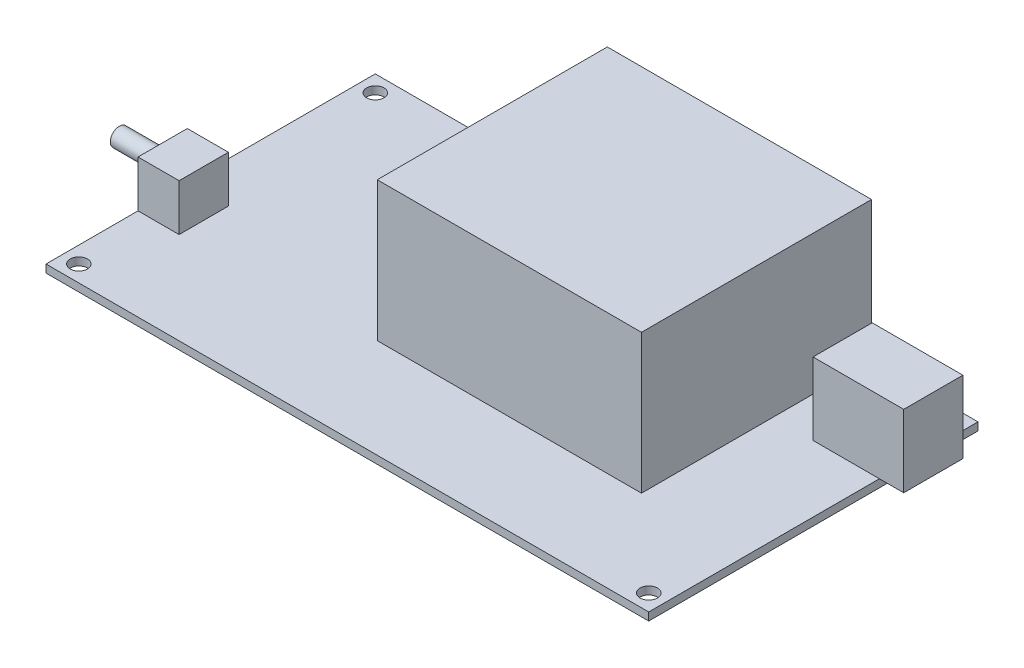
ISO-10303-21;
HEADER;
FILE_DESCRIPTION(('STEP AP214'),'2;1');
FILE_NAME('part.step','',(''),(''),'','','');
FILE_SCHEMA(('AUTOMOTIVE_DESIGN { 1 0 10303 214 1 1 1 1 }'));
ENDSEC;
DATA;
#1=APPLICATION_CONTEXT('core data for automotive mechanical design processes');
#2=APPLICATION_PROTOCOL_DEFINITION('international standard','automotive_design',2000,#1);
#3=PRODUCT_CONTEXT('',#1,'mechanical');
#4=PRODUCT('Part','Part','',(#3));
#5=PRODUCT_RELATED_PRODUCT_CATEGORY('part','',(#4));
#6=PRODUCT_DEFINITION_FORMATION('','',#4);
#7=PRODUCT_DEFINITION_CONTEXT('part definition',#1,'design');
#8=PRODUCT_DEFINITION('design','',#6,#7);
#9=PRODUCT_DEFINITION_SHAPE('','',#8);
#10=(LENGTH_UNIT() NAMED_UNIT(*) SI_UNIT(.MILLI.,.METRE.));
#11=(NAMED_UNIT(*) PLANE_ANGLE_UNIT() SI_UNIT($,.RADIAN.));
#12=(NAMED_UNIT(*) SI_UNIT($,.STERADIAN.) SOLID_ANGLE_UNIT());
#13=UNCERTAINTY_MEASURE_WITH_UNIT(LENGTH_MEASURE(1.E-05),#10,'distance_accuracy_value','');
#14=(GEOMETRIC_REPRESENTATION_CONTEXT(3) GLOBAL_UNCERTAINTY_ASSIGNED_CONTEXT((#13)) GLOBAL_UNIT_ASSIGNED_CONTEXT((#10,
#11,#12)) REPRESENTATION_CONTEXT('',''));
#15=CARTESIAN_POINT('',(0.,0.,0.));
#16=DIRECTION('',(0.,0.,1.));
#17=DIRECTION('',(1.,0.,0.));
#18=AXIS2_PLACEMENT_3D('',#15,#16,#17);
#19=CARTESIAN_POINT('',(0.,1.2,0.));
#20=DIRECTION('',(0.,1.,0.));
#21=DIRECTION('',(0.,0.,1.));
#22=AXIS2_PLACEMENT_3D('',#19,#20,#21);
#23=PLANE('',#22);
#24=CARTESIAN_POINT('',(-43.35,1.2,22.55));
#25=DIRECTION('',(0.,1.,0.));
#26=DIRECTION('',(0.,0.,1.));
#27=AXIS2_PLACEMENT_3D('',#24,#25,#26);
#28=CIRCLE('',#27,1.32);
#29=CARTESIAN_POINT('',(-43.35,1.2,23.87));
#30=VERTEX_POINT('',#29);
#31=EDGE_CURVE('E363',#30,#30,#28,.T.);
#32=ORIENTED_EDGE('',*,*,#31,.F.);
#33=EDGE_LOOP('',(#32));
#34=FACE_BOUND('',#33,.T.);
#35=CARTESIAN_POINT('',(43.35,1.2,22.55));
#36=DIRECTION('',(0.,1.,0.));
#37=DIRECTION('',(0.,0.,1.));
#38=AXIS2_PLACEMENT_3D('',#35,#36,#37);
#39=CIRCLE('',#38,1.32);
#40=CARTESIAN_POINT('',(43.35,1.2,23.87));
#41=VERTEX_POINT('',#40);
#42=EDGE_CURVE('E379',#41,#41,#39,.T.);
#43=ORIENTED_EDGE('',*,*,#42,.F.);
#44=EDGE_LOOP('',(#43));
#45=FACE_BOUND('',#44,.T.);
#46=CARTESIAN_POINT('',(-43.35,1.2,-22.55));
#47=DIRECTION('',(0.,1.,0.));
#48=DIRECTION('',(0.,0.,1.));
#49=AXIS2_PLACEMENT_3D('',#46,#47,#48);
#50=CIRCLE('',#49,1.32);
#51=CARTESIAN_POINT('',(-43.35,1.2,-21.23));
#52=VERTEX_POINT('',#51);
#53=EDGE_CURVE('E371',#52,#52,#50,.T.);
#54=ORIENTED_EDGE('',*,*,#53,.F.);
#55=EDGE_LOOP('',(#54));
#56=FACE_BOUND('',#55,.T.);
#57=CARTESIAN_POINT('',(43.35,1.2,-22.55));
#58=DIRECTION('',(0.,1.,0.));
#59=DIRECTION('',(0.,0.,1.));
#60=AXIS2_PLACEMENT_3D('',#57,#58,#59);
#61=CIRCLE('',#60,1.32);
#62=CARTESIAN_POINT('',(43.35,1.2,-21.23));
#63=VERTEX_POINT('',#62);
#64=EDGE_CURVE('E355',#63,#63,#61,.T.);
#65=ORIENTED_EDGE('',*,*,#64,.F.);
#66=EDGE_LOOP('',(#65));
#67=FACE_BOUND('',#66,.T.);
#68=DIRECTION('',(0.,0.,1.));
#69=VECTOR('',#68,1.);
#70=CARTESIAN_POINT('',(-45.85,1.2,-25.05));
#71=LINE('',#70,#69);
#72=CARTESIAN_POINT('',(-45.85,1.2,-25.05));
#73=VERTEX_POINT('',#72);
#74=CARTESIAN_POINT('',(-45.85,1.2,3.54999999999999));
#75=VERTEX_POINT('',#74);
#76=EDGE_CURVE('E398',#73,#75,#71,.T.);
#77=ORIENTED_EDGE('',*,*,#76,.T.);
#78=DIRECTION('',(-1.,0.,0.));
#79=VECTOR('',#78,1.);
#80=CARTESIAN_POINT('',(-45.85,1.2,3.54999999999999));
#81=LINE('',#80,#79);
#82=CARTESIAN_POINT('',(-39.6,1.2,3.54999999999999));
#83=VERTEX_POINT('',#82);
#84=EDGE_CURVE('E133',#83,#75,#81,.T.);
#85=ORIENTED_EDGE('',*,*,#84,.F.);
#86=DIRECTION('',(0.,0.,-1.));
#87=VECTOR('',#86,1.);
#88=CARTESIAN_POINT('',(-39.6,1.2,3.54999999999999));
#89=LINE('',#88,#87);
#90=CARTESIAN_POINT('',(-39.6,1.2,11.05));
#91=VERTEX_POINT('',#90);
#92=EDGE_CURVE('E138',#91,#83,#89,.T.);
#93=ORIENTED_EDGE('',*,*,#92,.F.);
#94=DIRECTION('',(1.,0.,0.));
#95=VECTOR('',#94,1.);
#96=CARTESIAN_POINT('',(-45.85,1.2,11.05));
#97=LINE('',#96,#95);
#98=CARTESIAN_POINT('',(-45.85,1.2,11.05));
#99=VERTEX_POINT('',#98);
#100=EDGE_CURVE('E257',#99,#91,#97,.T.);
#101=ORIENTED_EDGE('',*,*,#100,.F.);
#102=CARTESIAN_POINT('',(-45.85,1.2,25.05));
#103=VERTEX_POINT('',#102);
#104=EDGE_CURVE('E397',#99,#103,#71,.T.);
#105=ORIENTED_EDGE('',*,*,#104,.T.);
#106=DIRECTION('',(1.,0.,0.));
#107=VECTOR('',#106,1.);
#108=CARTESIAN_POINT('',(-45.85,1.2,25.05));
#109=LINE('',#108,#107);
#110=CARTESIAN_POINT('',(45.85,1.2,25.05));
#111=VERTEX_POINT('',#110);
#112=EDGE_CURVE('E401',#103,#111,#109,.T.);
#113=ORIENTED_EDGE('',*,*,#112,.T.);
#114=DIRECTION('',(0.,0.,-1.));
#115=VECTOR('',#114,1.);
#116=CARTESIAN_POINT('',(45.85,1.2,-25.05));
#117=LINE('',#116,#115);
#118=CARTESIAN_POINT('',(45.85,1.2,-10.05));
#119=VERTEX_POINT('',#118);
#120=EDGE_CURVE('E387',#111,#119,#117,.T.);
#121=ORIENTED_EDGE('',*,*,#120,.T.);
#122=DIRECTION('',(1.,0.,0.));
#123=VECTOR('',#122,1.);
#124=CARTESIAN_POINT('',(35.75,1.2,-10.05));
#125=LINE('',#124,#123);
#126=CARTESIAN_POINT('',(35.75,1.2,-10.05));
#127=VERTEX_POINT('',#126);
#128=EDGE_CURVE('E325',#127,#119,#125,.T.);
#129=ORIENTED_EDGE('',*,*,#128,.F.);
#130=DIRECTION('',(0.,0.,1.));
#131=VECTOR('',#130,1.);
#132=CARTESIAN_POINT('',(35.75,1.2,-19.05));
#133=LINE('',#132,#131);
#134=CARTESIAN_POINT('',(35.75,1.2,-19.05));
#135=VERTEX_POINT('',#134);
#136=EDGE_CURVE('E313',#135,#127,#133,.T.);
#137=ORIENTED_EDGE('',*,*,#136,.F.);
#138=DIRECTION('',(1.,0.,0.));
#139=VECTOR('',#138,1.);
#140=CARTESIAN_POINT('',(35.75,1.2,-19.05));
#141=LINE('',#140,#139);
#142=CARTESIAN_POINT('',(45.85,1.2,-19.05));
#143=VERTEX_POINT('',#142);
#144=EDGE_CURVE('E334',#135,#143,#141,.T.);
#145=ORIENTED_EDGE('',*,*,#144,.T.);
#146=CARTESIAN_POINT('',(45.85,1.2,-25.05));
#147=VERTEX_POINT('',#146);
#148=EDGE_CURVE('E393',#143,#147,#117,.T.);
#149=ORIENTED_EDGE('',*,*,#148,.T.);
#150=DIRECTION('',(-1.,0.,0.));
#151=VECTOR('',#150,1.);
#152=CARTESIAN_POINT('',(-45.85,1.2,-25.05));
#153=LINE('',#152,#151);
#154=CARTESIAN_POINT('',(29.65,1.2,-25.05));
#155=VERTEX_POINT('',#154);
#156=EDGE_CURVE('E394',#147,#155,#153,.T.);
#157=ORIENTED_EDGE('',*,*,#156,.T.);
#158=DIRECTION('',(0.,0.,-1.));
#159=VECTOR('',#158,1.);
#160=CARTESIAN_POINT('',(29.65,1.2,-25.05));
#161=LINE('',#160,#159);
#162=CARTESIAN_POINT('',(29.65,1.2,9.95));
#163=VERTEX_POINT('',#162);
#164=EDGE_CURVE('E261',#163,#155,#161,.T.);
#165=ORIENTED_EDGE('',*,*,#164,.F.);
#166=DIRECTION('',(1.,0.,0.));
#167=VECTOR('',#166,1.);
#168=CARTESIAN_POINT('',(29.65,1.2,9.95));
#169=LINE('',#168,#167);
#170=CARTESIAN_POINT('',(-10.55,1.2,9.95));
#171=VERTEX_POINT('',#170);
#172=EDGE_CURVE('E277',#171,#163,#169,.T.);
#173=ORIENTED_EDGE('',*,*,#172,.F.);
#174=DIRECTION('',(0.,0.,1.));
#175=VECTOR('',#174,1.);
#176=CARTESIAN_POINT('',(-10.55,1.2,-25.05));
#177=LINE('',#176,#175);
#178=CARTESIAN_POINT('',(-10.55,1.2,-25.05));
#179=VERTEX_POINT('',#178);
#180=EDGE_CURVE('E266',#179,#171,#177,.T.);
#181=ORIENTED_EDGE('',*,*,#180,.F.);
#182=EDGE_CURVE('E391',#179,#73,#153,.T.);
#183=ORIENTED_EDGE('',*,*,#182,.T.);
#184=EDGE_LOOP('',(#77,#85,#93,#101,#105,#113,#121,#129,#137,#145,#149,#157,#165,#173,#181,#183));
#185=FACE_BOUND('',#184,.T.);
#186=ADVANCED_FACE('F117',(#34,#45,#56,#67,#185),#23,.T.);
#187=CARTESIAN_POINT('',(0.,0.,0.));
#188=DIRECTION('',(0.,1.,0.));
#189=DIRECTION('',(0.,0.,1.));
#190=AXIS2_PLACEMENT_3D('',#187,#188,#189);
#191=PLANE('',#190);
#192=DIRECTION('',(0.,0.,-1.));
#193=VECTOR('',#192,1.);
#194=CARTESIAN_POINT('',(45.85,0.,-25.05));
#195=LINE('',#194,#193);
#196=CARTESIAN_POINT('',(45.85,0.,25.05));
#197=VERTEX_POINT('',#196);
#198=CARTESIAN_POINT('',(45.85,0.,-25.05));
#199=VERTEX_POINT('',#198);
#200=EDGE_CURVE('E383',#197,#199,#195,.T.);
#201=ORIENTED_EDGE('',*,*,#200,.F.);
#202=DIRECTION('',(1.,0.,0.));
#203=VECTOR('',#202,1.);
#204=CARTESIAN_POINT('',(-45.85,0.,25.05));
#205=LINE('',#204,#203);
#206=CARTESIAN_POINT('',(-45.85,0.,25.05));
#207=VERTEX_POINT('',#206);
#208=EDGE_CURVE('E414',#207,#197,#205,.T.);
#209=ORIENTED_EDGE('',*,*,#208,.F.);
#210=DIRECTION('',(0.,0.,1.));
#211=VECTOR('',#210,1.);
#212=CARTESIAN_POINT('',(-45.85,0.,-25.05));
#213=LINE('',#212,#211);
#214=CARTESIAN_POINT('',(-45.85,0.,-25.05));
#215=VERTEX_POINT('',#214);
#216=EDGE_CURVE('E411',#215,#207,#213,.T.);
#217=ORIENTED_EDGE('',*,*,#216,.F.);
#218=DIRECTION('',(-1.,0.,0.));
#219=VECTOR('',#218,1.);
#220=CARTESIAN_POINT('',(-45.85,0.,-25.05));
#221=LINE('',#220,#219);
#222=EDGE_CURVE('E408',#199,#215,#221,.T.);
#223=ORIENTED_EDGE('',*,*,#222,.F.);
#224=EDGE_LOOP('',(#201,#209,#217,#223));
#225=FACE_BOUND('',#224,.T.);
#226=CARTESIAN_POINT('',(43.35,0.,22.55));
#227=DIRECTION('',(0.,1.,0.));
#228=DIRECTION('',(0.,0.,1.));
#229=AXIS2_PLACEMENT_3D('',#226,#227,#228);
#230=CIRCLE('',#229,1.32);
#231=CARTESIAN_POINT('',(43.35,0.,23.87));
#232=VERTEX_POINT('',#231);
#233=EDGE_CURVE('E375',#232,#232,#230,.T.);
#234=ORIENTED_EDGE('',*,*,#233,.T.);
#235=EDGE_LOOP('',(#234));
#236=FACE_BOUND('',#235,.T.);
#237=CARTESIAN_POINT('',(-43.35,0.,-22.55));
#238=DIRECTION('',(0.,1.,0.));
#239=DIRECTION('',(0.,0.,1.));
#240=AXIS2_PLACEMENT_3D('',#237,#238,#239);
#241=CIRCLE('',#240,1.32);
#242=CARTESIAN_POINT('',(-43.35,0.,-21.23));
#243=VERTEX_POINT('',#242);
#244=EDGE_CURVE('E367',#243,#243,#241,.T.);
#245=ORIENTED_EDGE('',*,*,#244,.T.);
#246=EDGE_LOOP('',(#245));
#247=FACE_BOUND('',#246,.T.);
#248=CARTESIAN_POINT('',(-43.35,0.,22.55));
#249=DIRECTION('',(0.,1.,0.));
#250=DIRECTION('',(0.,0.,1.));
#251=AXIS2_PLACEMENT_3D('',#248,#249,#250);
#252=CIRCLE('',#251,1.32);
#253=CARTESIAN_POINT('',(-43.35,0.,23.87));
#254=VERTEX_POINT('',#253);
#255=EDGE_CURVE('E359',#254,#254,#252,.T.);
#256=ORIENTED_EDGE('',*,*,#255,.T.);
#257=EDGE_LOOP('',(#256));
#258=FACE_BOUND('',#257,.T.);
#259=CARTESIAN_POINT('',(43.35,0.,-22.55));
#260=DIRECTION('',(0.,1.,0.));
#261=DIRECTION('',(0.,0.,1.));
#262=AXIS2_PLACEMENT_3D('',#259,#260,#261);
#263=CIRCLE('',#262,1.32);
#264=CARTESIAN_POINT('',(43.35,0.,-21.23));
#265=VERTEX_POINT('',#264);
#266=EDGE_CURVE('E354',#265,#265,#263,.T.);
#267=ORIENTED_EDGE('',*,*,#266,.T.);
#268=EDGE_LOOP('',(#267));
#269=FACE_BOUND('',#268,.T.);
#270=ADVANCED_FACE('F441',(#225,#236,#247,#258,#269),#191,.F.);
#271=CARTESIAN_POINT('',(45.85,1.2,-25.05));
#272=DIRECTION('',(-1.,0.,0.));
#273=DIRECTION('',(0.,0.,1.));
#274=AXIS2_PLACEMENT_3D('',#271,#272,#273);
#275=PLANE('',#274);
#276=ORIENTED_EDGE('',*,*,#200,.T.);
#277=DIRECTION('',(0.,-1.,0.));
#278=VECTOR('',#277,1.);
#279=CARTESIAN_POINT('',(45.85,1.2,-25.05));
#280=LINE('',#279,#278);
#281=EDGE_CURVE('E126',#147,#199,#280,.T.);
#282=ORIENTED_EDGE('',*,*,#281,.F.);
#283=ORIENTED_EDGE('',*,*,#148,.F.);
#284=EDGE_CURVE('E392',#119,#143,#117,.T.);
#285=ORIENTED_EDGE('',*,*,#284,.F.);
#286=ORIENTED_EDGE('',*,*,#120,.F.);
#287=DIRECTION('',(0.,-1.,0.));
#288=VECTOR('',#287,1.);
#289=CARTESIAN_POINT('',(45.85,1.2,25.05));
#290=LINE('',#289,#288);
#291=EDGE_CURVE('E404',#111,#197,#290,.T.);
#292=ORIENTED_EDGE('',*,*,#291,.T.);
#293=EDGE_LOOP('',(#276,#282,#283,#285,#286,#292));
#294=FACE_BOUND('',#293,.T.);
#295=ADVANCED_FACE('F119',(#294),#275,.F.);
#296=CARTESIAN_POINT('',(-45.85,1.2,-25.05));
#297=DIRECTION('',(0.,0.,1.));
#298=DIRECTION('',(1.,0.,0.));
#299=AXIS2_PLACEMENT_3D('',#296,#297,#298);
#300=PLANE('',#299);
#301=ORIENTED_EDGE('',*,*,#222,.T.);
#302=DIRECTION('',(0.,-1.,0.));
#303=VECTOR('',#302,1.);
#304=CARTESIAN_POINT('',(-45.85,1.2,-25.05));
#305=LINE('',#304,#303);
#306=EDGE_CURVE('E424',#73,#215,#305,.T.);
#307=ORIENTED_EDGE('',*,*,#306,.F.);
#308=ORIENTED_EDGE('',*,*,#182,.F.);
#309=DIRECTION('',(0.,-1.,0.));
#310=VECTOR('',#309,1.);
#311=CARTESIAN_POINT('',(-10.55,22.4,-25.05));
#312=LINE('',#311,#310);
#313=CARTESIAN_POINT('',(-10.55,22.4,-25.05));
#314=VERTEX_POINT('',#313);
#315=EDGE_CURVE('E300',#314,#179,#312,.T.);
#316=ORIENTED_EDGE('',*,*,#315,.F.);
#317=DIRECTION('',(-1.,0.,0.));
#318=VECTOR('',#317,1.);
#319=CARTESIAN_POINT('',(29.65,22.4,-25.05));
#320=LINE('',#319,#318);
#321=CARTESIAN_POINT('',(29.65,22.4,-25.05));
#322=VERTEX_POINT('',#321);
#323=EDGE_CURVE('E276',#322,#314,#320,.T.);
#324=ORIENTED_EDGE('',*,*,#323,.F.);
#325=DIRECTION('',(0.,-1.,0.));
#326=VECTOR('',#325,1.);
#327=CARTESIAN_POINT('',(29.65,22.4,-25.05));
#328=LINE('',#327,#326);
#329=EDGE_CURVE('E304',#322,#155,#328,.T.);
#330=ORIENTED_EDGE('',*,*,#329,.T.);
#331=ORIENTED_EDGE('',*,*,#156,.F.);
#332=ORIENTED_EDGE('',*,*,#281,.T.);
#333=EDGE_LOOP('',(#301,#307,#308,#316,#324,#330,#331,#332));
#334=FACE_BOUND('',#333,.T.);
#335=ADVANCED_FACE('F432',(#334),#300,.F.);
#336=CARTESIAN_POINT('',(-45.85,1.2,-25.05));
#337=DIRECTION('',(1.,0.,0.));
#338=DIRECTION('',(0.,0.,-1.));
#339=AXIS2_PLACEMENT_3D('',#336,#337,#338);
#340=PLANE('',#339);
#341=CARTESIAN_POINT('',(-45.85,5.8,7.29999999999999));
#342=DIRECTION('',(1.,0.,0.));
#343=DIRECTION('',(0.,0.,-1.));
#344=AXIS2_PLACEMENT_3D('',#341,#342,#343);
#345=CIRCLE('',#344,1.37363755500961);
#346=CARTESIAN_POINT('',(-45.85,5.8,5.92636244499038));
#347=VERTEX_POINT('',#346);
#348=EDGE_CURVE('E15',#347,#347,#345,.F.);
#349=ORIENTED_EDGE('',*,*,#348,.F.);
#350=EDGE_LOOP('',(#349));
#351=FACE_BOUND('',#350,.T.);
#352=ORIENTED_EDGE('',*,*,#216,.T.);
#353=DIRECTION('',(0.,-1.,0.));
#354=VECTOR('',#353,1.);
#355=CARTESIAN_POINT('',(-45.85,1.2,25.05));
#356=LINE('',#355,#354);
#357=EDGE_CURVE('E420',#103,#207,#356,.T.);
#358=ORIENTED_EDGE('',*,*,#357,.F.);
#359=ORIENTED_EDGE('',*,*,#104,.F.);
#360=DIRECTION('',(0.,-1.,0.));
#361=VECTOR('',#360,1.);
#362=CARTESIAN_POINT('',(-45.85,8.3,11.05));
#363=LINE('',#362,#361);
#364=CARTESIAN_POINT('',(-45.85,8.3,11.05));
#365=VERTEX_POINT('',#364);
#366=EDGE_CURVE('E268',#365,#99,#363,.T.);
#367=ORIENTED_EDGE('',*,*,#366,.F.);
#368=DIRECTION('',(0.,0.,1.));
#369=VECTOR('',#368,1.);
#370=CARTESIAN_POINT('',(-45.85,8.3,3.54999999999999));
#371=LINE('',#370,#369);
#372=CARTESIAN_POINT('',(-45.85,8.3,3.54999999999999));
#373=VERTEX_POINT('',#372);
#374=EDGE_CURVE('E246',#373,#365,#371,.T.);
#375=ORIENTED_EDGE('',*,*,#374,.F.);
#376=DIRECTION('',(0.,-1.,0.));
#377=VECTOR('',#376,1.);
#378=CARTESIAN_POINT('',(-45.85,8.3,3.54999999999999));
#379=LINE('',#378,#377);
#380=EDGE_CURVE('E242',#373,#75,#379,.T.);
#381=ORIENTED_EDGE('',*,*,#380,.T.);
#382=ORIENTED_EDGE('',*,*,#76,.F.);
#383=ORIENTED_EDGE('',*,*,#306,.T.);
#384=EDGE_LOOP('',(#352,#358,#359,#367,#375,#381,#382,#383));
#385=FACE_BOUND('',#384,.T.);
#386=ADVANCED_FACE('F446',(#351,#385),#340,.F.);
#387=CARTESIAN_POINT('',(-45.85,1.2,25.05));
#388=DIRECTION('',(0.,0.,-1.));
#389=DIRECTION('',(-1.,0.,0.));
#390=AXIS2_PLACEMENT_3D('',#387,#388,#389);
#391=PLANE('',#390);
#392=ORIENTED_EDGE('',*,*,#208,.T.);
#393=ORIENTED_EDGE('',*,*,#291,.F.);
#394=ORIENTED_EDGE('',*,*,#112,.F.);
#395=ORIENTED_EDGE('',*,*,#357,.T.);
#396=EDGE_LOOP('',(#392,#393,#394,#395));
#397=FACE_BOUND('',#396,.T.);
#398=ADVANCED_FACE('F450',(#397),#391,.F.);
#399=CARTESIAN_POINT('',(43.35,1.2,22.55));
#400=DIRECTION('',(0.,-1.,0.));
#401=DIRECTION('',(0.,0.,-1.));
#402=AXIS2_PLACEMENT_3D('',#399,#400,#401);
#403=CYLINDRICAL_SURFACE('',#402,1.32);
#404=ORIENTED_EDGE('',*,*,#42,.T.);
#405=EDGE_LOOP('',(#404));
#406=FACE_BOUND('',#405,.T.);
#407=ORIENTED_EDGE('',*,*,#233,.F.);
#408=EDGE_LOOP('',(#407));
#409=FACE_BOUND('',#408,.T.);
#410=ADVANCED_FACE('F502',(#406,#409),#403,.F.);
#411=CARTESIAN_POINT('',(-43.35,1.2,-22.55));
#412=DIRECTION('',(0.,-1.,0.));
#413=DIRECTION('',(0.,0.,-1.));
#414=AXIS2_PLACEMENT_3D('',#411,#412,#413);
#415=CYLINDRICAL_SURFACE('',#414,1.32);
#416=ORIENTED_EDGE('',*,*,#53,.T.);
#417=EDGE_LOOP('',(#416));
#418=FACE_BOUND('',#417,.T.);
#419=ORIENTED_EDGE('',*,*,#244,.F.);
#420=EDGE_LOOP('',(#419));
#421=FACE_BOUND('',#420,.T.);
#422=ADVANCED_FACE('F537',(#418,#421),#415,.F.);
#423=CARTESIAN_POINT('',(-43.35,1.2,22.55));
#424=DIRECTION('',(0.,-1.,0.));
#425=DIRECTION('',(0.,0.,-1.));
#426=AXIS2_PLACEMENT_3D('',#423,#424,#425);
#427=CYLINDRICAL_SURFACE('',#426,1.32);
#428=ORIENTED_EDGE('',*,*,#31,.T.);
#429=EDGE_LOOP('',(#428));
#430=FACE_BOUND('',#429,.T.);
#431=ORIENTED_EDGE('',*,*,#255,.F.);
#432=EDGE_LOOP('',(#431));
#433=FACE_BOUND('',#432,.T.);
#434=ADVANCED_FACE('F546',(#430,#433),#427,.F.);
#435=CARTESIAN_POINT('',(43.35,1.2,-22.55));
#436=DIRECTION('',(0.,-1.,0.));
#437=DIRECTION('',(0.,0.,-1.));
#438=AXIS2_PLACEMENT_3D('',#435,#436,#437);
#439=CYLINDRICAL_SURFACE('',#438,1.32);
#440=ORIENTED_EDGE('',*,*,#64,.T.);
#441=EDGE_LOOP('',(#440));
#442=FACE_BOUND('',#441,.T.);
#443=ORIENTED_EDGE('',*,*,#266,.F.);
#444=EDGE_LOOP('',(#443));
#445=FACE_BOUND('',#444,.T.);
#446=ADVANCED_FACE('F554',(#442,#445),#439,.F.);
#447=CARTESIAN_POINT('',(35.75,12.2,-10.05));
#448=DIRECTION('',(0.,0.,-1.));
#449=DIRECTION('',(-1.,0.,0.));
#450=AXIS2_PLACEMENT_3D('',#447,#448,#449);
#451=PLANE('',#450);
#452=ORIENTED_EDGE('',*,*,#128,.T.);
#453=CARTESIAN_POINT('',(49.55,1.2,-10.05));
#454=VERTEX_POINT('',#453);
#455=EDGE_CURVE('E308',#119,#454,#125,.T.);
#456=ORIENTED_EDGE('',*,*,#455,.T.);
#457=DIRECTION('',(0.,-1.,0.));
#458=VECTOR('',#457,1.);
#459=CARTESIAN_POINT('',(49.55,12.2,-10.05));
#460=LINE('',#459,#458);
#461=CARTESIAN_POINT('',(49.55,12.2,-10.05));
#462=VERTEX_POINT('',#461);
#463=EDGE_CURVE('E350',#462,#454,#460,.T.);
#464=ORIENTED_EDGE('',*,*,#463,.F.);
#465=DIRECTION('',(1.,0.,0.));
#466=VECTOR('',#465,1.);
#467=CARTESIAN_POINT('',(35.75,12.2,-10.05));
#468=LINE('',#467,#466);
#469=CARTESIAN_POINT('',(35.75,12.2,-10.05));
#470=VERTEX_POINT('',#469);
#471=EDGE_CURVE('E309',#470,#462,#468,.T.);
#472=ORIENTED_EDGE('',*,*,#471,.F.);
#473=DIRECTION('',(0.,-1.,0.));
#474=VECTOR('',#473,1.);
#475=CARTESIAN_POINT('',(35.75,12.2,-10.05));
#476=LINE('',#475,#474);
#477=EDGE_CURVE('E324',#470,#127,#476,.T.);
#478=ORIENTED_EDGE('',*,*,#477,.T.);
#479=EDGE_LOOP('',(#452,#456,#464,#472,#478));
#480=FACE_BOUND('',#479,.T.);
#481=ADVANCED_FACE('F463',(#480),#451,.F.);
#482=CARTESIAN_POINT('',(49.55,12.2,-19.05));
#483=DIRECTION('',(1.,0.,0.));
#484=DIRECTION('',(0.,0.,-1.));
#485=AXIS2_PLACEMENT_3D('',#482,#483,#484);
#486=PLANE('',#485);
#487=DIRECTION('',(0.,0.,1.));
#488=VECTOR('',#487,1.);
#489=CARTESIAN_POINT('',(49.55,1.2,-19.05));
#490=LINE('',#489,#488);
#491=CARTESIAN_POINT('',(49.55,1.2,-19.05));
#492=VERTEX_POINT('',#491);
#493=EDGE_CURVE('E329',#492,#454,#490,.T.);
#494=ORIENTED_EDGE('',*,*,#493,.F.);
#495=DIRECTION('',(0.,-1.,0.));
#496=VECTOR('',#495,1.);
#497=CARTESIAN_POINT('',(49.55,12.2,-19.05));
#498=LINE('',#497,#496);
#499=CARTESIAN_POINT('',(49.55,12.2,-19.05));
#500=VERTEX_POINT('',#499);
#501=EDGE_CURVE('E346',#500,#492,#498,.T.);
#502=ORIENTED_EDGE('',*,*,#501,.F.);
#503=DIRECTION('',(0.,0.,1.));
#504=VECTOR('',#503,1.);
#505=CARTESIAN_POINT('',(49.55,12.2,-19.05));
#506=LINE('',#505,#504);
#507=EDGE_CURVE('E312',#500,#462,#506,.T.);
#508=ORIENTED_EDGE('',*,*,#507,.T.);
#509=ORIENTED_EDGE('',*,*,#463,.T.);
#510=EDGE_LOOP('',(#494,#502,#508,#509));
#511=FACE_BOUND('',#510,.T.);
#512=ADVANCED_FACE('F469',(#511),#486,.T.);
#513=CARTESIAN_POINT('',(35.75,12.2,-19.05));
#514=DIRECTION('',(0.,0.,-1.));
#515=DIRECTION('',(-1.,0.,0.));
#516=AXIS2_PLACEMENT_3D('',#513,#514,#515);
#517=PLANE('',#516);
#518=ORIENTED_EDGE('',*,*,#144,.F.);
#519=DIRECTION('',(0.,-1.,0.));
#520=VECTOR('',#519,1.);
#521=CARTESIAN_POINT('',(35.75,12.2,-19.05));
#522=LINE('',#521,#520);
#523=CARTESIAN_POINT('',(35.75,12.2,-19.05));
#524=VERTEX_POINT('',#523);
#525=EDGE_CURVE('E343',#524,#135,#522,.T.);
#526=ORIENTED_EDGE('',*,*,#525,.F.);
#527=DIRECTION('',(1.,0.,0.));
#528=VECTOR('',#527,1.);
#529=CARTESIAN_POINT('',(35.75,12.2,-19.05));
#530=LINE('',#529,#528);
#531=EDGE_CURVE('E317',#524,#500,#530,.T.);
#532=ORIENTED_EDGE('',*,*,#531,.T.);
#533=ORIENTED_EDGE('',*,*,#501,.T.);
#534=EDGE_CURVE('E333',#143,#492,#141,.T.);
#535=ORIENTED_EDGE('',*,*,#534,.F.);
#536=EDGE_LOOP('',(#518,#526,#532,#533,#535));
#537=FACE_BOUND('',#536,.T.);
#538=ADVANCED_FACE('F474',(#537),#517,.T.);
#539=CARTESIAN_POINT('',(35.75,12.2,-19.05));
#540=DIRECTION('',(1.,0.,0.));
#541=DIRECTION('',(0.,0.,-1.));
#542=AXIS2_PLACEMENT_3D('',#539,#540,#541);
#543=PLANE('',#542);
#544=ORIENTED_EDGE('',*,*,#136,.T.);
#545=ORIENTED_EDGE('',*,*,#477,.F.);
#546=DIRECTION('',(0.,0.,1.));
#547=VECTOR('',#546,1.);
#548=CARTESIAN_POINT('',(35.75,12.2,-19.05));
#549=LINE('',#548,#547);
#550=EDGE_CURVE('E321',#524,#470,#549,.T.);
#551=ORIENTED_EDGE('',*,*,#550,.F.);
#552=ORIENTED_EDGE('',*,*,#525,.T.);
#553=EDGE_LOOP('',(#544,#545,#551,#552));
#554=FACE_BOUND('',#553,.T.);
#555=ADVANCED_FACE('F482',(#554),#543,.F.);
#556=CARTESIAN_POINT('',(0.,12.2,0.));
#557=DIRECTION('',(0.,-1.,0.));
#558=DIRECTION('',(0.,0.,-1.));
#559=AXIS2_PLACEMENT_3D('',#556,#557,#558);
#560=PLANE('',#559);
#561=ORIENTED_EDGE('',*,*,#471,.T.);
#562=ORIENTED_EDGE('',*,*,#507,.F.);
#563=ORIENTED_EDGE('',*,*,#531,.F.);
#564=ORIENTED_EDGE('',*,*,#550,.T.);
#565=EDGE_LOOP('',(#561,#562,#563,#564));
#566=FACE_BOUND('',#565,.T.);
#567=ADVANCED_FACE('F477',(#566),#560,.F.);
#568=CARTESIAN_POINT('',(0.,1.2,0.));
#569=DIRECTION('',(0.,-1.,0.));
#570=DIRECTION('',(0.,0.,-1.));
#571=AXIS2_PLACEMENT_3D('',#568,#569,#570);
#572=PLANE('',#571);
#573=ORIENTED_EDGE('',*,*,#455,.F.);
#574=ORIENTED_EDGE('',*,*,#284,.T.);
#575=ORIENTED_EDGE('',*,*,#534,.T.);
#576=ORIENTED_EDGE('',*,*,#493,.T.);
#577=EDGE_LOOP('',(#573,#574,#575,#576));
#578=FACE_BOUND('',#577,.T.);
#579=ADVANCED_FACE('F471',(#578),#572,.T.);
#580=CARTESIAN_POINT('',(29.65,22.4,-25.05));
#581=DIRECTION('',(-1.,0.,0.));
#582=DIRECTION('',(0.,0.,1.));
#583=AXIS2_PLACEMENT_3D('',#580,#581,#582);
#584=PLANE('',#583);
#585=ORIENTED_EDGE('',*,*,#164,.T.);
#586=ORIENTED_EDGE('',*,*,#329,.F.);
#587=DIRECTION('',(0.,0.,-1.));
#588=VECTOR('',#587,1.);
#589=CARTESIAN_POINT('',(29.65,22.4,-25.05));
#590=LINE('',#589,#588);
#591=CARTESIAN_POINT('',(29.65,22.4,9.95));
#592=VERTEX_POINT('',#591);
#593=EDGE_CURVE('E272',#592,#322,#590,.T.);
#594=ORIENTED_EDGE('',*,*,#593,.F.);
#595=DIRECTION('',(0.,-1.,0.));
#596=VECTOR('',#595,1.);
#597=CARTESIAN_POINT('',(29.65,22.4,9.95));
#598=LINE('',#597,#596);
#599=EDGE_CURVE('E285',#592,#163,#598,.T.);
#600=ORIENTED_EDGE('',*,*,#599,.T.);
#601=EDGE_LOOP('',(#585,#586,#594,#600));
#602=FACE_BOUND('',#601,.T.);
#603=ADVANCED_FACE('F599',(#602),#584,.F.);
#604=CARTESIAN_POINT('',(-10.55,22.4,-25.05));
#605=DIRECTION('',(1.,0.,0.));
#606=DIRECTION('',(0.,0.,-1.));
#607=AXIS2_PLACEMENT_3D('',#604,#605,#606);
#608=PLANE('',#607);
#609=ORIENTED_EDGE('',*,*,#180,.T.);
#610=DIRECTION('',(0.,-1.,0.));
#611=VECTOR('',#610,1.);
#612=CARTESIAN_POINT('',(-10.55,22.4,9.95));
#613=LINE('',#612,#611);
#614=CARTESIAN_POINT('',(-10.55,22.4,9.95));
#615=VERTEX_POINT('',#614);
#616=EDGE_CURVE('E296',#615,#171,#613,.T.);
#617=ORIENTED_EDGE('',*,*,#616,.F.);
#618=DIRECTION('',(0.,0.,1.));
#619=VECTOR('',#618,1.);
#620=CARTESIAN_POINT('',(-10.55,22.4,-25.05));
#621=LINE('',#620,#619);
#622=EDGE_CURVE('E280',#314,#615,#621,.T.);
#623=ORIENTED_EDGE('',*,*,#622,.F.);
#624=ORIENTED_EDGE('',*,*,#315,.T.);
#625=EDGE_LOOP('',(#609,#617,#623,#624));
#626=FACE_BOUND('',#625,.T.);
#627=ADVANCED_FACE('F613',(#626),#608,.F.);
#628=CARTESIAN_POINT('',(29.65,22.4,9.95));
#629=DIRECTION('',(0.,0.,-1.));
#630=DIRECTION('',(-1.,0.,0.));
#631=AXIS2_PLACEMENT_3D('',#628,#629,#630);
#632=PLANE('',#631);
#633=ORIENTED_EDGE('',*,*,#172,.T.);
#634=ORIENTED_EDGE('',*,*,#599,.F.);
#635=DIRECTION('',(1.,0.,0.));
#636=VECTOR('',#635,1.);
#637=CARTESIAN_POINT('',(29.65,22.4,9.95));
#638=LINE('',#637,#636);
#639=EDGE_CURVE('E283',#615,#592,#638,.T.);
#640=ORIENTED_EDGE('',*,*,#639,.F.);
#641=ORIENTED_EDGE('',*,*,#616,.T.);
#642=EDGE_LOOP('',(#633,#634,#640,#641));
#643=FACE_BOUND('',#642,.T.);
#644=ADVANCED_FACE('F623',(#643),#632,.F.);
#645=CARTESIAN_POINT('',(0.,22.4,0.));
#646=DIRECTION('',(0.,-1.,0.));
#647=DIRECTION('',(0.,0.,-1.));
#648=AXIS2_PLACEMENT_3D('',#645,#646,#647);
#649=PLANE('',#648);
#650=ORIENTED_EDGE('',*,*,#593,.T.);
#651=ORIENTED_EDGE('',*,*,#323,.T.);
#652=ORIENTED_EDGE('',*,*,#622,.T.);
#653=ORIENTED_EDGE('',*,*,#639,.T.);
#654=EDGE_LOOP('',(#650,#651,#652,#653));
#655=FACE_BOUND('',#654,.T.);
#656=ADVANCED_FACE('F633',(#655),#649,.F.);
#657=CARTESIAN_POINT('',(-39.6,8.3,3.54999999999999));
#658=DIRECTION('',(-1.,0.,0.));
#659=DIRECTION('',(0.,0.,1.));
#660=AXIS2_PLACEMENT_3D('',#657,#658,#659);
#661=PLANE('',#660);
#662=ORIENTED_EDGE('',*,*,#92,.T.);
#663=DIRECTION('',(0.,-1.,0.));
#664=VECTOR('',#663,1.);
#665=CARTESIAN_POINT('',(-39.6,8.3,3.54999999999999));
#666=LINE('',#665,#664);
#667=CARTESIAN_POINT('',(-39.6,8.3,3.54999999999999));
#668=VERTEX_POINT('',#667);
#669=EDGE_CURVE('E240',#668,#83,#666,.T.);
#670=ORIENTED_EDGE('',*,*,#669,.F.);
#671=DIRECTION('',(0.,0.,-1.));
#672=VECTOR('',#671,1.);
#673=CARTESIAN_POINT('',(-39.6,8.3,3.54999999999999));
#674=LINE('',#673,#672);
#675=CARTESIAN_POINT('',(-39.6,8.3,11.05));
#676=VERTEX_POINT('',#675);
#677=EDGE_CURVE('E247',#676,#668,#674,.T.);
#678=ORIENTED_EDGE('',*,*,#677,.F.);
#679=DIRECTION('',(0.,-1.,0.));
#680=VECTOR('',#679,1.);
#681=CARTESIAN_POINT('',(-39.6,8.3,11.05));
#682=LINE('',#681,#680);
#683=EDGE_CURVE('E722',#676,#91,#682,.T.);
#684=ORIENTED_EDGE('',*,*,#683,.T.);
#685=EDGE_LOOP('',(#662,#670,#678,#684));
#686=FACE_BOUND('',#685,.T.);
#687=ADVANCED_FACE('F259',(#686),#661,.F.);
#688=CARTESIAN_POINT('',(-45.85,8.3,3.54999999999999));
#689=DIRECTION('',(0.,0.,1.));
#690=DIRECTION('',(1.,0.,0.));
#691=AXIS2_PLACEMENT_3D('',#688,#689,#690);
#692=PLANE('',#691);
#693=ORIENTED_EDGE('',*,*,#84,.T.);
#694=ORIENTED_EDGE('',*,*,#380,.F.);
#695=DIRECTION('',(-1.,0.,0.));
#696=VECTOR('',#695,1.);
#697=CARTESIAN_POINT('',(-45.85,8.3,3.54999999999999));
#698=LINE('',#697,#696);
#699=EDGE_CURVE('E236',#668,#373,#698,.T.);
#700=ORIENTED_EDGE('',*,*,#699,.F.);
#701=ORIENTED_EDGE('',*,*,#669,.T.);
#702=EDGE_LOOP('',(#693,#694,#700,#701));
#703=FACE_BOUND('',#702,.T.);
#704=ADVANCED_FACE('F238',(#703),#692,.F.);
#705=CARTESIAN_POINT('',(-45.85,8.3,11.05));
#706=DIRECTION('',(0.,0.,-1.));
#707=DIRECTION('',(-1.,0.,0.));
#708=AXIS2_PLACEMENT_3D('',#705,#706,#707);
#709=PLANE('',#708);
#710=ORIENTED_EDGE('',*,*,#100,.T.);
#711=ORIENTED_EDGE('',*,*,#683,.F.);
#712=DIRECTION('',(1.,0.,0.));
#713=VECTOR('',#712,1.);
#714=CARTESIAN_POINT('',(-45.85,8.3,11.05));
#715=LINE('',#714,#713);
#716=EDGE_CURVE('E252',#365,#676,#715,.T.);
#717=ORIENTED_EDGE('',*,*,#716,.F.);
#718=ORIENTED_EDGE('',*,*,#366,.T.);
#719=EDGE_LOOP('',(#710,#711,#717,#718));
#720=FACE_BOUND('',#719,.T.);
#721=ADVANCED_FACE('F665',(#720),#709,.F.);
#722=CARTESIAN_POINT('',(0.,8.3,0.));
#723=DIRECTION('',(0.,1.,0.));
#724=DIRECTION('',(0.,0.,1.));
#725=AXIS2_PLACEMENT_3D('',#722,#723,#724);
#726=PLANE('',#725);
#727=ORIENTED_EDGE('',*,*,#677,.T.);
#728=ORIENTED_EDGE('',*,*,#699,.T.);
#729=ORIENTED_EDGE('',*,*,#374,.T.);
#730=ORIENTED_EDGE('',*,*,#716,.T.);
#731=EDGE_LOOP('',(#727,#728,#729,#730));
#732=FACE_BOUND('',#731,.T.);
#733=ADVANCED_FACE('F250',(#732),#726,.T.);
#734=CARTESIAN_POINT('',(-52.45,5.8,7.29999999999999));
#735=DIRECTION('',(1.,0.,0.));
#736=DIRECTION('',(0.,0.,-1.));
#737=AXIS2_PLACEMENT_3D('',#734,#735,#736);
#738=CYLINDRICAL_SURFACE('',#737,1.37363755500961);
#739=CARTESIAN_POINT('',(-52.45,5.8,7.29999999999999));
#740=DIRECTION('',(-1.,0.,0.));
#741=DIRECTION('',(0.,0.,1.));
#742=AXIS2_PLACEMENT_3D('',#739,#740,#741);
#743=CIRCLE('',#742,1.37363755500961);
#744=CARTESIAN_POINT('',(-52.45,5.8,8.6736375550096));
#745=VERTEX_POINT('',#744);
#746=EDGE_CURVE('E713',#745,#745,#743,.T.);
#747=ORIENTED_EDGE('',*,*,#746,.F.);
#748=EDGE_LOOP('',(#747));
#749=FACE_BOUND('',#748,.T.);
#750=ORIENTED_EDGE('',*,*,#348,.T.);
#751=EDGE_LOOP('',(#750));
#752=FACE_BOUND('',#751,.T.);
#753=ADVANCED_FACE('F683',(#749,#752),#738,.T.);
#754=CARTESIAN_POINT('',(-52.45,5.8,7.29999999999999));
#755=DIRECTION('',(-1.,0.,0.));
#756=DIRECTION('',(0.,0.,1.));
#757=AXIS2_PLACEMENT_3D('',#754,#755,#756);
#758=PLANE('',#757);
#759=ORIENTED_EDGE('',*,*,#746,.T.);
#760=EDGE_LOOP('',(#759));
#761=FACE_BOUND('',#760,.T.);
#762=ADVANCED_FACE('F697',(#761),#758,.T.);
#763=CLOSED_SHELL('',(#186,#270,#295,#335,#386,#398,#410,#422,#434,#446,#481,#512,#538,#555,
#567,#579,#603,#627,#644,#656,#687,#704,#721,#733,#753,#762));
#764=MANIFOLD_SOLID_BREP('B2',#763);
#765=ADVANCED_BREP_SHAPE_REPRESENTATION('',(#18,#764),#14);
#766=SHAPE_DEFINITION_REPRESENTATION(#9,#765);
ENDSEC;
END-ISO-10303-21;
